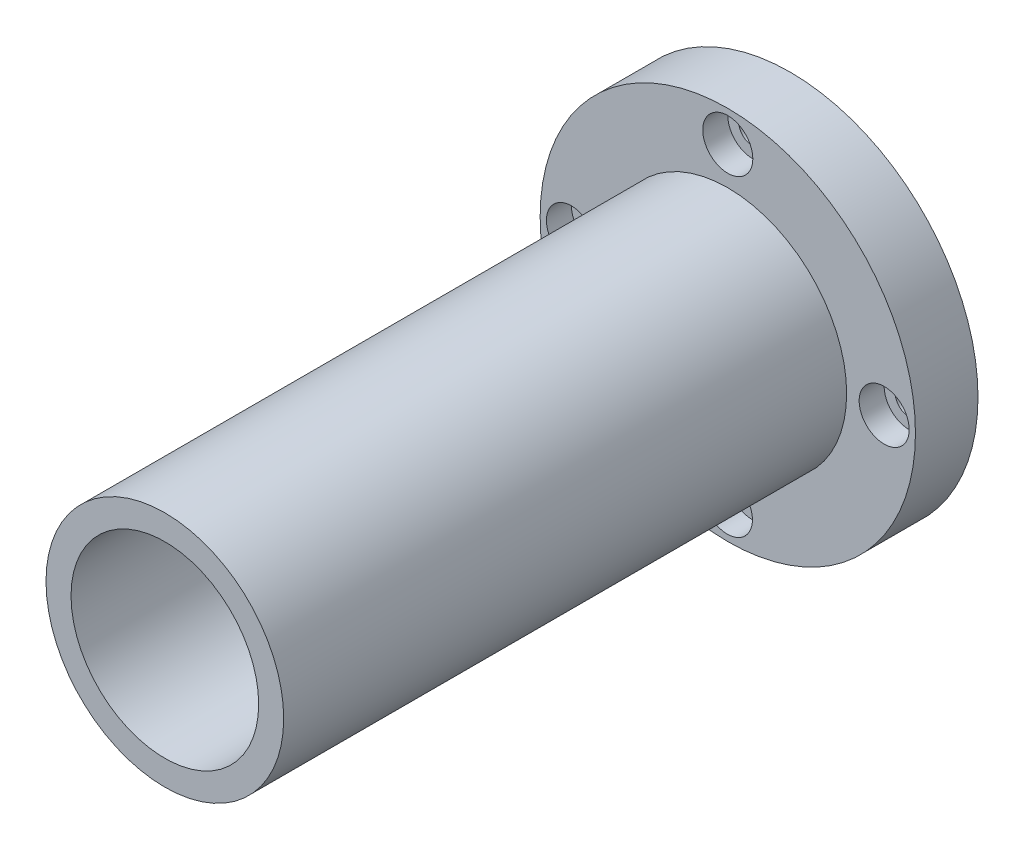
ISO-10303-21;
HEADER;
FILE_DESCRIPTION(('STEP AP214'),'2;1');
FILE_NAME('part.step','',(''),(''),'','','');
FILE_SCHEMA(('AUTOMOTIVE_DESIGN { 1 0 10303 214 1 1 1 1 }'));
ENDSEC;
DATA;
#1=APPLICATION_CONTEXT('core data for automotive mechanical design processes');
#2=APPLICATION_PROTOCOL_DEFINITION('international standard','automotive_design',2000,#1);
#3=PRODUCT_CONTEXT('',#1,'mechanical');
#4=PRODUCT('Part','Part','',(#3));
#5=PRODUCT_RELATED_PRODUCT_CATEGORY('part','',(#4));
#6=PRODUCT_DEFINITION_FORMATION('','',#4);
#7=PRODUCT_DEFINITION_CONTEXT('part definition',#1,'design');
#8=PRODUCT_DEFINITION('design','',#6,#7);
#9=PRODUCT_DEFINITION_SHAPE('','',#8);
#10=(LENGTH_UNIT() NAMED_UNIT(*) SI_UNIT(.MILLI.,.METRE.));
#11=(NAMED_UNIT(*) PLANE_ANGLE_UNIT() SI_UNIT($,.RADIAN.));
#12=(NAMED_UNIT(*) SI_UNIT($,.STERADIAN.) SOLID_ANGLE_UNIT());
#13=UNCERTAINTY_MEASURE_WITH_UNIT(LENGTH_MEASURE(1.E-05),#10,'distance_accuracy_value','');
#14=(GEOMETRIC_REPRESENTATION_CONTEXT(3) GLOBAL_UNCERTAINTY_ASSIGNED_CONTEXT((#13)) GLOBAL_UNIT_ASSIGNED_CONTEXT((#10,
#11,#12)) REPRESENTATION_CONTEXT('',''));
#15=CARTESIAN_POINT('',(0.,0.,0.));
#16=DIRECTION('',(0.,0.,1.));
#17=DIRECTION('',(1.,0.,0.));
#18=AXIS2_PLACEMENT_3D('',#15,#16,#17);
#19=CARTESIAN_POINT('',(0.,0.,10.));
#20=DIRECTION('',(0.,0.,1.));
#21=DIRECTION('',(1.,0.,0.));
#22=AXIS2_PLACEMENT_3D('',#19,#20,#21);
#23=PLANE('',#22);
#24=CARTESIAN_POINT('',(0.,25.,10.));
#25=DIRECTION('',(0.,0.,1.));
#26=DIRECTION('',(1.,0.,0.));
#27=AXIS2_PLACEMENT_3D('',#24,#25,#26);
#28=CIRCLE('',#27,4.);
#29=CARTESIAN_POINT('',(4.,25.,10.));
#30=VERTEX_POINT('',#29);
#31=EDGE_CURVE('E102',#30,#30,#28,.T.);
#32=ORIENTED_EDGE('',*,*,#31,.F.);
#33=EDGE_LOOP('',(#32));
#34=FACE_BOUND('',#33,.T.);
#35=CARTESIAN_POINT('',(25.,0.,10.));
#36=DIRECTION('',(0.,0.,1.));
#37=DIRECTION('',(1.,0.,0.));
#38=AXIS2_PLACEMENT_3D('',#35,#36,#37);
#39=CIRCLE('',#38,4.);
#40=CARTESIAN_POINT('',(29.,0.,10.));
#41=VERTEX_POINT('',#40);
#42=EDGE_CURVE('E90',#41,#41,#39,.T.);
#43=ORIENTED_EDGE('',*,*,#42,.F.);
#44=EDGE_LOOP('',(#43));
#45=FACE_BOUND('',#44,.T.);
#46=CARTESIAN_POINT('',(-0.0635752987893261,-24.999919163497,10.));
#47=DIRECTION('',(0.,0.,1.));
#48=DIRECTION('',(1.,0.,0.));
#49=AXIS2_PLACEMENT_3D('',#46,#47,#48);
#50=CIRCLE('',#49,4.);
#51=CARTESIAN_POINT('',(3.93642470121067,-24.999919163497,10.));
#52=VERTEX_POINT('',#51);
#53=EDGE_CURVE('E78',#52,#52,#50,.T.);
#54=ORIENTED_EDGE('',*,*,#53,.F.);
#55=EDGE_LOOP('',(#54));
#56=FACE_BOUND('',#55,.T.);
#57=CARTESIAN_POINT('',(-25.,0.,10.));
#58=DIRECTION('',(0.,0.,1.));
#59=DIRECTION('',(1.,0.,0.));
#60=AXIS2_PLACEMENT_3D('',#57,#58,#59);
#61=CIRCLE('',#60,4.);
#62=CARTESIAN_POINT('',(-21.,0.,10.));
#63=VERTEX_POINT('',#62);
#64=EDGE_CURVE('E66',#63,#63,#61,.T.);
#65=ORIENTED_EDGE('',*,*,#64,.F.);
#66=EDGE_LOOP('',(#65));
#67=FACE_BOUND('',#66,.T.);
#68=CARTESIAN_POINT('',(0.,0.,10.));
#69=DIRECTION('',(0.,0.,1.));
#70=DIRECTION('',(1.,0.,0.));
#71=AXIS2_PLACEMENT_3D('',#68,#69,#70);
#72=CIRCLE('',#71,30.);
#73=CARTESIAN_POINT('',(30.,0.,10.));
#74=VERTEX_POINT('',#73);
#75=EDGE_CURVE('E10',#74,#74,#72,.T.);
#76=ORIENTED_EDGE('',*,*,#75,.T.);
#77=EDGE_LOOP('',(#76));
#78=FACE_BOUND('',#77,.T.);
#79=CARTESIAN_POINT('',(0.,0.,10.));
#80=DIRECTION('',(0.,0.,1.));
#81=DIRECTION('',(1.,0.,0.));
#82=AXIS2_PLACEMENT_3D('',#79,#80,#81);
#83=CIRCLE('',#82,19.);
#84=CARTESIAN_POINT('',(-19.,0.,10.));
#85=VERTEX_POINT('',#84);
#86=EDGE_CURVE('E49',#85,#85,#83,.T.);
#87=ORIENTED_EDGE('',*,*,#86,.F.);
#88=EDGE_LOOP('',(#87));
#89=FACE_BOUND('',#88,.T.);
#90=ADVANCED_FACE('F33',(#34,#45,#56,#67,#78,#89),#23,.T.);
#91=CARTESIAN_POINT('',(0.,0.,0.));
#92=DIRECTION('',(0.,0.,1.));
#93=DIRECTION('',(1.,0.,0.));
#94=AXIS2_PLACEMENT_3D('',#91,#92,#93);
#95=PLANE('',#94);
#96=CARTESIAN_POINT('',(0.,25.,0.));
#97=DIRECTION('',(0.,0.,1.));
#98=DIRECTION('',(1.,0.,0.));
#99=AXIS2_PLACEMENT_3D('',#96,#97,#98);
#100=CIRCLE('',#99,2.25);
#101=CARTESIAN_POINT('',(2.25,25.,0.));
#102=VERTEX_POINT('',#101);
#103=EDGE_CURVE('E93',#102,#102,#100,.T.);
#104=ORIENTED_EDGE('',*,*,#103,.T.);
#105=EDGE_LOOP('',(#104));
#106=FACE_BOUND('',#105,.T.);
#107=CARTESIAN_POINT('',(25.,0.,0.));
#108=DIRECTION('',(0.,0.,1.));
#109=DIRECTION('',(1.,0.,0.));
#110=AXIS2_PLACEMENT_3D('',#107,#108,#109);
#111=CIRCLE('',#110,2.25);
#112=CARTESIAN_POINT('',(27.25,0.,0.));
#113=VERTEX_POINT('',#112);
#114=EDGE_CURVE('E81',#113,#113,#111,.T.);
#115=ORIENTED_EDGE('',*,*,#114,.T.);
#116=EDGE_LOOP('',(#115));
#117=FACE_BOUND('',#116,.T.);
#118=CARTESIAN_POINT('',(-0.0635752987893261,-24.999919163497,0.));
#119=DIRECTION('',(0.,0.,1.));
#120=DIRECTION('',(1.,0.,0.));
#121=AXIS2_PLACEMENT_3D('',#118,#119,#120);
#122=CIRCLE('',#121,2.25);
#123=CARTESIAN_POINT('',(2.18642470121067,-24.999919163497,0.));
#124=VERTEX_POINT('',#123);
#125=EDGE_CURVE('E69',#124,#124,#122,.T.);
#126=ORIENTED_EDGE('',*,*,#125,.T.);
#127=EDGE_LOOP('',(#126));
#128=FACE_BOUND('',#127,.T.);
#129=CARTESIAN_POINT('',(-25.,0.,0.));
#130=DIRECTION('',(0.,0.,1.));
#131=DIRECTION('',(1.,0.,0.));
#132=AXIS2_PLACEMENT_3D('',#129,#130,#131);
#133=CIRCLE('',#132,2.25);
#134=CARTESIAN_POINT('',(-22.75,0.,0.));
#135=VERTEX_POINT('',#134);
#136=EDGE_CURVE('E57',#135,#135,#133,.T.);
#137=ORIENTED_EDGE('',*,*,#136,.T.);
#138=EDGE_LOOP('',(#137));
#139=FACE_BOUND('',#138,.T.);
#140=CARTESIAN_POINT('',(0.,0.,0.));
#141=DIRECTION('',(0.,0.,1.));
#142=DIRECTION('',(1.,0.,0.));
#143=AXIS2_PLACEMENT_3D('',#140,#141,#142);
#144=CIRCLE('',#143,30.);
#145=CARTESIAN_POINT('',(30.,0.,0.));
#146=VERTEX_POINT('',#145);
#147=EDGE_CURVE('E37',#146,#146,#144,.T.);
#148=ORIENTED_EDGE('',*,*,#147,.F.);
#149=EDGE_LOOP('',(#148));
#150=FACE_BOUND('',#149,.T.);
#151=CARTESIAN_POINT('',(0.,0.,0.));
#152=DIRECTION('',(0.,0.,1.));
#153=DIRECTION('',(1.,0.,0.));
#154=AXIS2_PLACEMENT_3D('',#151,#152,#153);
#155=CIRCLE('',#154,15.);
#156=CARTESIAN_POINT('',(15.,0.,0.));
#157=VERTEX_POINT('',#156);
#158=EDGE_CURVE('E44',#157,#157,#155,.T.);
#159=ORIENTED_EDGE('',*,*,#158,.T.);
#160=EDGE_LOOP('',(#159));
#161=FACE_BOUND('',#160,.T.);
#162=ADVANCED_FACE('F110',(#106,#117,#128,#139,#150,#161),#95,.F.);
#163=CARTESIAN_POINT('',(0.,0.,10.));
#164=DIRECTION('',(0.,0.,-1.));
#165=DIRECTION('',(-1.,0.,0.));
#166=AXIS2_PLACEMENT_3D('',#163,#164,#165);
#167=CYLINDRICAL_SURFACE('',#166,30.);
#168=ORIENTED_EDGE('',*,*,#75,.F.);
#169=EDGE_LOOP('',(#168));
#170=FACE_BOUND('',#169,.T.);
#171=ORIENTED_EDGE('',*,*,#147,.T.);
#172=EDGE_LOOP('',(#171));
#173=FACE_BOUND('',#172,.T.);
#174=ADVANCED_FACE('F35',(#170,#173),#167,.T.);
#175=CARTESIAN_POINT('',(0.,0.,10.));
#176=DIRECTION('',(0.,0.,-1.));
#177=DIRECTION('',(-1.,0.,0.));
#178=AXIS2_PLACEMENT_3D('',#175,#176,#177);
#179=CYLINDRICAL_SURFACE('',#178,15.);
#180=ORIENTED_EDGE('',*,*,#158,.F.);
#181=EDGE_LOOP('',(#180));
#182=FACE_BOUND('',#181,.T.);
#183=CARTESIAN_POINT('',(0.,0.,100.));
#184=DIRECTION('',(0.,0.,1.));
#185=DIRECTION('',(1.,0.,0.));
#186=AXIS2_PLACEMENT_3D('',#183,#184,#185);
#187=CIRCLE('',#186,15.);
#188=CARTESIAN_POINT('',(15.,0.,100.));
#189=VERTEX_POINT('',#188);
#190=EDGE_CURVE('E52',#189,#189,#187,.T.);
#191=ORIENTED_EDGE('',*,*,#190,.T.);
#192=EDGE_LOOP('',(#191));
#193=FACE_BOUND('',#192,.T.);
#194=ADVANCED_FACE('F133',(#182,#193),#179,.F.);
#195=CARTESIAN_POINT('',(0.,0.,100.));
#196=DIRECTION('',(0.,0.,1.));
#197=DIRECTION('',(1.,0.,0.));
#198=AXIS2_PLACEMENT_3D('',#195,#196,#197);
#199=PLANE('',#198);
#200=CARTESIAN_POINT('',(0.,0.,100.));
#201=DIRECTION('',(0.,0.,1.));
#202=DIRECTION('',(1.,0.,0.));
#203=AXIS2_PLACEMENT_3D('',#200,#201,#202);
#204=CIRCLE('',#203,19.);
#205=CARTESIAN_POINT('',(-19.,0.,100.));
#206=VERTEX_POINT('',#205);
#207=EDGE_CURVE('E48',#206,#206,#204,.T.);
#208=ORIENTED_EDGE('',*,*,#207,.T.);
#209=EDGE_LOOP('',(#208));
#210=FACE_BOUND('',#209,.T.);
#211=ORIENTED_EDGE('',*,*,#190,.F.);
#212=EDGE_LOOP('',(#211));
#213=FACE_BOUND('',#212,.T.);
#214=ADVANCED_FACE('F123',(#210,#213),#199,.T.);
#215=CARTESIAN_POINT('',(0.,0.,100.));
#216=DIRECTION('',(0.,0.,-1.));
#217=DIRECTION('',(-1.,0.,0.));
#218=AXIS2_PLACEMENT_3D('',#215,#216,#217);
#219=CYLINDRICAL_SURFACE('',#218,19.);
#220=CARTESIAN_POINT('',(-19.,0.,100.));
#221=CARTESIAN_POINT('',(-19.,0.,99.0625));
#222=CARTESIAN_POINT('',(-19.,0.,98.125));
#223=CARTESIAN_POINT('',(-19.,0.,96.25));
#224=CARTESIAN_POINT('',(-19.,0.,95.3125));
#225=CARTESIAN_POINT('',(-19.,0.,93.4375));
#226=CARTESIAN_POINT('',(-19.,0.,92.5));
#227=CARTESIAN_POINT('',(-19.,0.,90.625));
#228=CARTESIAN_POINT('',(-19.,0.,89.6875));
#229=CARTESIAN_POINT('',(-19.,0.,87.8125));
#230=CARTESIAN_POINT('',(-19.,0.,86.875));
#231=CARTESIAN_POINT('',(-19.,0.,85.));
#232=CARTESIAN_POINT('',(-19.,0.,84.0625));
#233=CARTESIAN_POINT('',(-19.,0.,82.1875));
#234=CARTESIAN_POINT('',(-19.,0.,81.25));
#235=CARTESIAN_POINT('',(-19.,0.,79.375));
#236=CARTESIAN_POINT('',(-19.,0.,78.4375));
#237=CARTESIAN_POINT('',(-19.,0.,76.5625));
#238=CARTESIAN_POINT('',(-19.,0.,75.625));
#239=CARTESIAN_POINT('',(-19.,0.,73.75));
#240=CARTESIAN_POINT('',(-19.,0.,72.8125));
#241=CARTESIAN_POINT('',(-19.,0.,70.9375));
#242=CARTESIAN_POINT('',(-19.,0.,70.));
#243=CARTESIAN_POINT('',(-19.,0.,68.125));
#244=CARTESIAN_POINT('',(-19.,0.,67.1875));
#245=CARTESIAN_POINT('',(-19.,0.,65.3125));
#246=CARTESIAN_POINT('',(-19.,0.,64.375));
#247=CARTESIAN_POINT('',(-19.,0.,62.5));
#248=CARTESIAN_POINT('',(-19.,0.,61.5625));
#249=CARTESIAN_POINT('',(-19.,0.,59.6875));
#250=CARTESIAN_POINT('',(-19.,0.,58.75));
#251=CARTESIAN_POINT('',(-19.,0.,56.875));
#252=CARTESIAN_POINT('',(-19.,0.,55.9375));
#253=CARTESIAN_POINT('',(-19.,0.,54.0625));
#254=CARTESIAN_POINT('',(-19.,0.,53.125));
#255=CARTESIAN_POINT('',(-19.,0.,51.25));
#256=CARTESIAN_POINT('',(-19.,0.,50.3125));
#257=CARTESIAN_POINT('',(-19.,0.,48.4375));
#258=CARTESIAN_POINT('',(-19.,0.,47.5));
#259=CARTESIAN_POINT('',(-19.,0.,45.625));
#260=CARTESIAN_POINT('',(-19.,0.,44.6875));
#261=CARTESIAN_POINT('',(-19.,0.,42.8125));
#262=CARTESIAN_POINT('',(-19.,0.,41.875));
#263=CARTESIAN_POINT('',(-19.,0.,40.));
#264=CARTESIAN_POINT('',(-19.,0.,39.0625));
#265=CARTESIAN_POINT('',(-19.,0.,37.1875));
#266=CARTESIAN_POINT('',(-19.,0.,36.25));
#267=CARTESIAN_POINT('',(-19.,0.,34.375));
#268=CARTESIAN_POINT('',(-19.,0.,33.4375));
#269=CARTESIAN_POINT('',(-19.,0.,31.5625));
#270=CARTESIAN_POINT('',(-19.,0.,30.625));
#271=CARTESIAN_POINT('',(-19.,0.,28.75));
#272=CARTESIAN_POINT('',(-19.,0.,27.8125));
#273=CARTESIAN_POINT('',(-19.,0.,25.9375));
#274=CARTESIAN_POINT('',(-19.,0.,25.));
#275=CARTESIAN_POINT('',(-19.,0.,23.125));
#276=CARTESIAN_POINT('',(-19.,0.,22.1875));
#277=CARTESIAN_POINT('',(-19.,0.,20.3125));
#278=CARTESIAN_POINT('',(-19.,0.,19.375));
#279=CARTESIAN_POINT('',(-19.,0.,17.5));
#280=CARTESIAN_POINT('',(-19.,0.,16.5625));
#281=CARTESIAN_POINT('',(-19.,0.,14.6875));
#282=CARTESIAN_POINT('',(-19.,0.,13.75));
#283=CARTESIAN_POINT('',(-19.,0.,11.875));
#284=CARTESIAN_POINT('',(-19.,0.,10.9375));
#285=CARTESIAN_POINT('',(-19.,0.,10.));
#286=B_SPLINE_CURVE_WITH_KNOTS('',3,(#220,#221,#222,#223,#224,#225,#226,#227,#228,#229,#230,
#231,#232,#233,#234,#235,#236,#237,#238,#239,#240,#241,#242,#243,#244,#245,#246,#247,#248,#249,
#250,#251,#252,#253,#254,#255,#256,#257,#258,#259,#260,#261,#262,#263,#264,#265,#266,#267,#268,
#269,#270,#271,#272,#273,#274,#275,#276,#277,#278,#279,#280,#281,#282,#283,#284,#285),
.UNSPECIFIED.,.F.,.F.,(4,2,2,2,2,2,2,2,2,2,2,2,2,2,2,2,2,2,2,2,2,2,2,2,2,2,2,2,2,2,2,2,4),(0.,
2.8125,5.62499999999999,8.43749999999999,11.25,14.0625,16.875,19.6875,22.5,25.3125,28.125,
30.9375,33.75,36.5625,39.375,42.1875,45.,47.8125,50.625,53.4375,56.25,59.0625,61.875,64.6875,
67.5,70.3125,73.125,75.9375,78.75,81.5625,84.375,87.1875,90.),.UNSPECIFIED.);
#287=EDGE_CURVE('BSEAM120',#206,#85,#286,.T.);
#288=ORIENTED_EDGE('',*,*,#207,.F.);
#289=ORIENTED_EDGE('',*,*,#86,.T.);
#290=ORIENTED_EDGE('',*,*,#287,.T.);
#291=ORIENTED_EDGE('',*,*,#287,.F.);
#292=EDGE_LOOP('',(#288,#290,#289,#291));
#293=FACE_BOUND('',#292,.T.);
#294=ADVANCED_FACE('F120',(#293),#219,.T.);
#295=CARTESIAN_POINT('',(-25.,0.,10.));
#296=DIRECTION('',(0.,0.,1.));
#297=DIRECTION('',(1.,0.,0.));
#298=AXIS2_PLACEMENT_3D('',#295,#296,#297);
#299=CYLINDRICAL_SURFACE('',#298,2.25);
#300=ORIENTED_EDGE('',*,*,#136,.F.);
#301=EDGE_LOOP('',(#300));
#302=FACE_BOUND('',#301,.T.);
#303=CARTESIAN_POINT('',(-25.,0.,6.));
#304=DIRECTION('',(0.,0.,1.));
#305=DIRECTION('',(1.,0.,0.));
#306=AXIS2_PLACEMENT_3D('',#303,#304,#305);
#307=CIRCLE('',#306,2.25);
#308=CARTESIAN_POINT('',(-22.75,0.,6.));
#309=VERTEX_POINT('',#308);
#310=EDGE_CURVE('E60',#309,#309,#307,.T.);
#311=ORIENTED_EDGE('',*,*,#310,.T.);
#312=EDGE_LOOP('',(#311));
#313=FACE_BOUND('',#312,.T.);
#314=ADVANCED_FACE('F122',(#302,#313),#299,.F.);
#315=CARTESIAN_POINT('',(-22.75,0.,6.));
#316=DIRECTION('',(0.,0.,-1.));
#317=DIRECTION('',(-1.,0.,0.));
#318=AXIS2_PLACEMENT_3D('',#315,#316,#317);
#319=PLANE('',#318);
#320=ORIENTED_EDGE('',*,*,#310,.F.);
#321=EDGE_LOOP('',(#320));
#322=FACE_BOUND('',#321,.T.);
#323=CARTESIAN_POINT('',(-25.,0.,6.));
#324=DIRECTION('',(0.,0.,1.));
#325=DIRECTION('',(1.,0.,0.));
#326=AXIS2_PLACEMENT_3D('',#323,#324,#325);
#327=CIRCLE('',#326,4.);
#328=CARTESIAN_POINT('',(-21.,0.,6.));
#329=VERTEX_POINT('',#328);
#330=EDGE_CURVE('E63',#329,#329,#327,.T.);
#331=ORIENTED_EDGE('',*,*,#330,.T.);
#332=EDGE_LOOP('',(#331));
#333=FACE_BOUND('',#332,.T.);
#334=ADVANCED_FACE('F130',(#322,#333),#319,.F.);
#335=CARTESIAN_POINT('',(-25.,0.,10.));
#336=DIRECTION('',(0.,0.,1.));
#337=DIRECTION('',(1.,0.,0.));
#338=AXIS2_PLACEMENT_3D('',#335,#336,#337);
#339=CYLINDRICAL_SURFACE('',#338,4.);
#340=ORIENTED_EDGE('',*,*,#330,.F.);
#341=EDGE_LOOP('',(#340));
#342=FACE_BOUND('',#341,.T.);
#343=ORIENTED_EDGE('',*,*,#64,.T.);
#344=EDGE_LOOP('',(#343));
#345=FACE_BOUND('',#344,.T.);
#346=ADVANCED_FACE('F166',(#342,#345),#339,.F.);
#347=CARTESIAN_POINT('',(-0.0635752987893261,-24.999919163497,10.));
#348=DIRECTION('',(0.,0.,1.));
#349=DIRECTION('',(1.,0.,0.));
#350=AXIS2_PLACEMENT_3D('',#347,#348,#349);
#351=CYLINDRICAL_SURFACE('',#350,2.25);
#352=ORIENTED_EDGE('',*,*,#125,.F.);
#353=EDGE_LOOP('',(#352));
#354=FACE_BOUND('',#353,.T.);
#355=CARTESIAN_POINT('',(-0.0635752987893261,-24.999919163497,6.));
#356=DIRECTION('',(0.,0.,1.));
#357=DIRECTION('',(1.,0.,0.));
#358=AXIS2_PLACEMENT_3D('',#355,#356,#357);
#359=CIRCLE('',#358,2.25);
#360=CARTESIAN_POINT('',(2.18642470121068,-24.999919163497,6.));
#361=VERTEX_POINT('',#360);
#362=EDGE_CURVE('E72',#361,#361,#359,.T.);
#363=ORIENTED_EDGE('',*,*,#362,.T.);
#364=EDGE_LOOP('',(#363));
#365=FACE_BOUND('',#364,.T.);
#366=ADVANCED_FACE('F172',(#354,#365),#351,.F.);
#367=CARTESIAN_POINT('',(2.18642470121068,-24.999919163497,6.));
#368=DIRECTION('',(0.,0.,-1.));
#369=DIRECTION('',(-1.,0.,0.));
#370=AXIS2_PLACEMENT_3D('',#367,#368,#369);
#371=PLANE('',#370);
#372=ORIENTED_EDGE('',*,*,#362,.F.);
#373=EDGE_LOOP('',(#372));
#374=FACE_BOUND('',#373,.T.);
#375=CARTESIAN_POINT('',(-0.0635752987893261,-24.999919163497,6.));
#376=DIRECTION('',(0.,0.,1.));
#377=DIRECTION('',(1.,0.,0.));
#378=AXIS2_PLACEMENT_3D('',#375,#376,#377);
#379=CIRCLE('',#378,4.);
#380=CARTESIAN_POINT('',(3.93642470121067,-24.999919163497,6.));
#381=VERTEX_POINT('',#380);
#382=EDGE_CURVE('E75',#381,#381,#379,.T.);
#383=ORIENTED_EDGE('',*,*,#382,.T.);
#384=EDGE_LOOP('',(#383));
#385=FACE_BOUND('',#384,.T.);
#386=ADVANCED_FACE('F177',(#374,#385),#371,.F.);
#387=CARTESIAN_POINT('',(-0.0635752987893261,-24.999919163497,10.));
#388=DIRECTION('',(0.,0.,1.));
#389=DIRECTION('',(1.,0.,0.));
#390=AXIS2_PLACEMENT_3D('',#387,#388,#389);
#391=CYLINDRICAL_SURFACE('',#390,4.);
#392=ORIENTED_EDGE('',*,*,#382,.F.);
#393=EDGE_LOOP('',(#392));
#394=FACE_BOUND('',#393,.T.);
#395=ORIENTED_EDGE('',*,*,#53,.T.);
#396=EDGE_LOOP('',(#395));
#397=FACE_BOUND('',#396,.T.);
#398=ADVANCED_FACE('F183',(#394,#397),#391,.F.);
#399=CARTESIAN_POINT('',(25.,0.,10.));
#400=DIRECTION('',(0.,0.,1.));
#401=DIRECTION('',(1.,0.,0.));
#402=AXIS2_PLACEMENT_3D('',#399,#400,#401);
#403=CYLINDRICAL_SURFACE('',#402,2.25);
#404=ORIENTED_EDGE('',*,*,#114,.F.);
#405=EDGE_LOOP('',(#404));
#406=FACE_BOUND('',#405,.T.);
#407=CARTESIAN_POINT('',(25.,0.,6.));
#408=DIRECTION('',(0.,0.,1.));
#409=DIRECTION('',(1.,0.,0.));
#410=AXIS2_PLACEMENT_3D('',#407,#408,#409);
#411=CIRCLE('',#410,2.25);
#412=CARTESIAN_POINT('',(27.25,0.,6.));
#413=VERTEX_POINT('',#412);
#414=EDGE_CURVE('E84',#413,#413,#411,.T.);
#415=ORIENTED_EDGE('',*,*,#414,.T.);
#416=EDGE_LOOP('',(#415));
#417=FACE_BOUND('',#416,.T.);
#418=ADVANCED_FACE('F187',(#406,#417),#403,.F.);
#419=CARTESIAN_POINT('',(27.25,0.,6.));
#420=DIRECTION('',(0.,0.,-1.));
#421=DIRECTION('',(-1.,0.,0.));
#422=AXIS2_PLACEMENT_3D('',#419,#420,#421);
#423=PLANE('',#422);
#424=ORIENTED_EDGE('',*,*,#414,.F.);
#425=EDGE_LOOP('',(#424));
#426=FACE_BOUND('',#425,.T.);
#427=CARTESIAN_POINT('',(25.,0.,6.));
#428=DIRECTION('',(0.,0.,1.));
#429=DIRECTION('',(1.,0.,0.));
#430=AXIS2_PLACEMENT_3D('',#427,#428,#429);
#431=CIRCLE('',#430,4.);
#432=CARTESIAN_POINT('',(29.,0.,6.));
#433=VERTEX_POINT('',#432);
#434=EDGE_CURVE('E87',#433,#433,#431,.T.);
#435=ORIENTED_EDGE('',*,*,#434,.T.);
#436=EDGE_LOOP('',(#435));
#437=FACE_BOUND('',#436,.T.);
#438=ADVANCED_FACE('F191',(#426,#437),#423,.F.);
#439=CARTESIAN_POINT('',(25.,0.,10.));
#440=DIRECTION('',(0.,0.,1.));
#441=DIRECTION('',(1.,0.,0.));
#442=AXIS2_PLACEMENT_3D('',#439,#440,#441);
#443=CYLINDRICAL_SURFACE('',#442,4.);
#444=ORIENTED_EDGE('',*,*,#434,.F.);
#445=EDGE_LOOP('',(#444));
#446=FACE_BOUND('',#445,.T.);
#447=ORIENTED_EDGE('',*,*,#42,.T.);
#448=EDGE_LOOP('',(#447));
#449=FACE_BOUND('',#448,.T.);
#450=ADVANCED_FACE('F195',(#446,#449),#443,.F.);
#451=CARTESIAN_POINT('',(0.,25.,10.));
#452=DIRECTION('',(0.,0.,1.));
#453=DIRECTION('',(1.,0.,0.));
#454=AXIS2_PLACEMENT_3D('',#451,#452,#453);
#455=CYLINDRICAL_SURFACE('',#454,2.25);
#456=ORIENTED_EDGE('',*,*,#103,.F.);
#457=EDGE_LOOP('',(#456));
#458=FACE_BOUND('',#457,.T.);
#459=CARTESIAN_POINT('',(0.,25.,6.));
#460=DIRECTION('',(0.,0.,1.));
#461=DIRECTION('',(1.,0.,0.));
#462=AXIS2_PLACEMENT_3D('',#459,#460,#461);
#463=CIRCLE('',#462,2.25);
#464=CARTESIAN_POINT('',(2.25,25.,6.));
#465=VERTEX_POINT('',#464);
#466=EDGE_CURVE('E96',#465,#465,#463,.T.);
#467=ORIENTED_EDGE('',*,*,#466,.T.);
#468=EDGE_LOOP('',(#467));
#469=FACE_BOUND('',#468,.T.);
#470=ADVANCED_FACE('F199',(#458,#469),#455,.F.);
#471=CARTESIAN_POINT('',(2.25,25.,6.));
#472=DIRECTION('',(0.,0.,-1.));
#473=DIRECTION('',(-1.,0.,0.));
#474=AXIS2_PLACEMENT_3D('',#471,#472,#473);
#475=PLANE('',#474);
#476=ORIENTED_EDGE('',*,*,#466,.F.);
#477=EDGE_LOOP('',(#476));
#478=FACE_BOUND('',#477,.T.);
#479=CARTESIAN_POINT('',(0.,25.,6.));
#480=DIRECTION('',(0.,0.,1.));
#481=DIRECTION('',(1.,0.,0.));
#482=AXIS2_PLACEMENT_3D('',#479,#480,#481);
#483=CIRCLE('',#482,4.);
#484=CARTESIAN_POINT('',(4.,25.,6.));
#485=VERTEX_POINT('',#484);
#486=EDGE_CURVE('E99',#485,#485,#483,.T.);
#487=ORIENTED_EDGE('',*,*,#486,.T.);
#488=EDGE_LOOP('',(#487));
#489=FACE_BOUND('',#488,.T.);
#490=ADVANCED_FACE('F203',(#478,#489),#475,.F.);
#491=CARTESIAN_POINT('',(0.,25.,10.));
#492=DIRECTION('',(0.,0.,1.));
#493=DIRECTION('',(1.,0.,0.));
#494=AXIS2_PLACEMENT_3D('',#491,#492,#493);
#495=CYLINDRICAL_SURFACE('',#494,4.);
#496=ORIENTED_EDGE('',*,*,#486,.F.);
#497=EDGE_LOOP('',(#496));
#498=FACE_BOUND('',#497,.T.);
#499=ORIENTED_EDGE('',*,*,#31,.T.);
#500=EDGE_LOOP('',(#499));
#501=FACE_BOUND('',#500,.T.);
#502=ADVANCED_FACE('F106',(#498,#501),#495,.F.);
#503=CLOSED_SHELL('',(#90,#162,#174,#194,#214,#294,#314,#334,#346,#366,#386,#398,#418,#438,#450,
#470,#490,#502));
#504=MANIFOLD_SOLID_BREP('B2',#503);
#505=ADVANCED_BREP_SHAPE_REPRESENTATION('',(#18,#504),#14);
#506=SHAPE_DEFINITION_REPRESENTATION(#9,#505);
ENDSEC;
END-ISO-10303-21;
